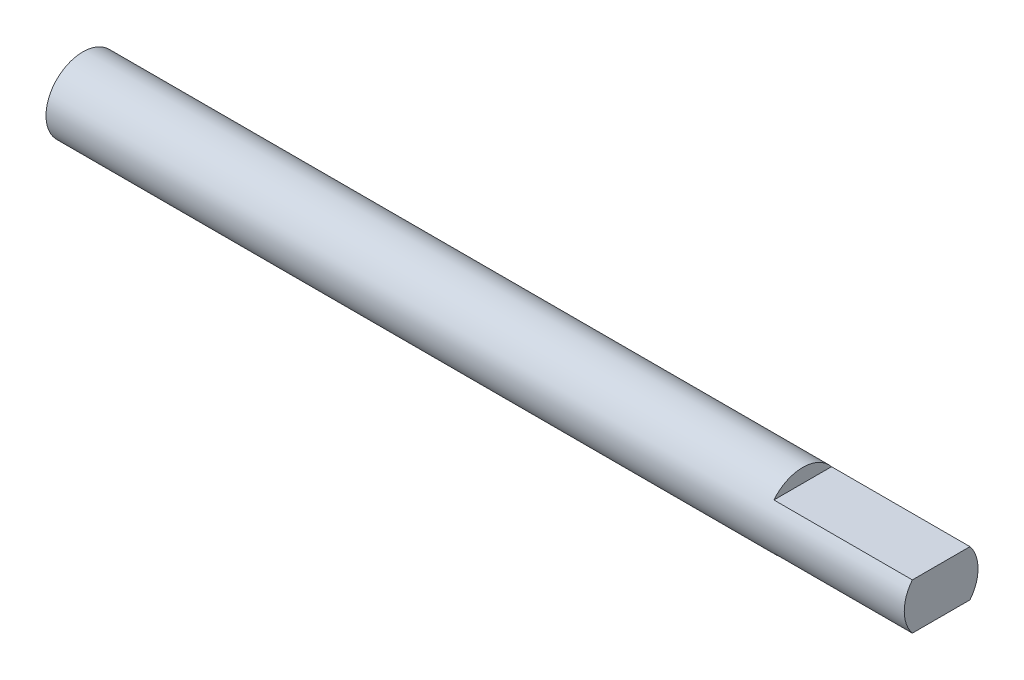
ISO-10303-21;
HEADER;
FILE_DESCRIPTION(('STEP AP214'),'2;1');
FILE_NAME('part.step','',(''),(''),'','','');
FILE_SCHEMA(('AUTOMOTIVE_DESIGN { 1 0 10303 214 1 1 1 1 }'));
ENDSEC;
DATA;
#1=APPLICATION_CONTEXT('core data for automotive mechanical design processes');
#2=APPLICATION_PROTOCOL_DEFINITION('international standard','automotive_design',2000,#1);
#3=PRODUCT_CONTEXT('',#1,'mechanical');
#4=PRODUCT('Part','Part','',(#3));
#5=PRODUCT_RELATED_PRODUCT_CATEGORY('part','',(#4));
#6=PRODUCT_DEFINITION_FORMATION('','',#4);
#7=PRODUCT_DEFINITION_CONTEXT('part definition',#1,'design');
#8=PRODUCT_DEFINITION('design','',#6,#7);
#9=PRODUCT_DEFINITION_SHAPE('','',#8);
#10=(LENGTH_UNIT() NAMED_UNIT(*) SI_UNIT(.MILLI.,.METRE.));
#11=(NAMED_UNIT(*) PLANE_ANGLE_UNIT() SI_UNIT($,.RADIAN.));
#12=(NAMED_UNIT(*) SI_UNIT($,.STERADIAN.) SOLID_ANGLE_UNIT());
#13=UNCERTAINTY_MEASURE_WITH_UNIT(LENGTH_MEASURE(1.E-05),#10,'distance_accuracy_value','');
#14=(GEOMETRIC_REPRESENTATION_CONTEXT(3) GLOBAL_UNCERTAINTY_ASSIGNED_CONTEXT((#13)) GLOBAL_UNIT_ASSIGNED_CONTEXT((#10,
#11,#12)) REPRESENTATION_CONTEXT('',''));
#15=CARTESIAN_POINT('',(0.,0.,0.));
#16=DIRECTION('',(0.,0.,1.));
#17=DIRECTION('',(1.,0.,0.));
#18=AXIS2_PLACEMENT_3D('',#15,#16,#17);
#19=CARTESIAN_POINT('',(0.,0.,0.));
#20=DIRECTION('',(1.,0.,0.));
#21=DIRECTION('',(0.,0.,-1.));
#22=AXIS2_PLACEMENT_3D('',#19,#20,#21);
#23=PLANE('',#22);
#24=CARTESIAN_POINT('',(0.,0.,0.));
#25=DIRECTION('',(-1.,0.,0.));
#26=DIRECTION('',(0.,0.,1.));
#27=AXIS2_PLACEMENT_3D('',#24,#25,#26);
#28=CIRCLE('',#27,4.);
#29=CARTESIAN_POINT('',(0.,0.,4.));
#30=VERTEX_POINT('',#29);
#31=EDGE_CURVE('E90',#30,#30,#28,.T.);
#32=ORIENTED_EDGE('',*,*,#31,.T.);
#33=EDGE_LOOP('',(#32));
#34=FACE_BOUND('',#33,.T.);
#35=ADVANCED_FACE('F33',(#34),#23,.F.);
#36=CARTESIAN_POINT('',(0.,0.,0.));
#37=DIRECTION('',(-1.,0.,0.));
#38=DIRECTION('',(0.,0.,1.));
#39=AXIS2_PLACEMENT_3D('',#36,#37,#38);
#40=CYLINDRICAL_SURFACE('',#39,4.);
#41=CARTESIAN_POINT('',(93.,0.,0.));
#42=DIRECTION('',(-1.,0.,0.));
#43=DIRECTION('',(0.,0.,1.));
#44=AXIS2_PLACEMENT_3D('',#41,#42,#43);
#45=CIRCLE('',#44,4.);
#46=CARTESIAN_POINT('',(93.,2.5,-3.1224989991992));
#47=VERTEX_POINT('',#46);
#48=CARTESIAN_POINT('',(93.,-2.49999999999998,-3.12249899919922));
#49=VERTEX_POINT('',#48);
#50=EDGE_CURVE('E87',#47,#49,#45,.T.);
#51=ORIENTED_EDGE('',*,*,#50,.T.);
#52=DIRECTION('',(-1.,0.,0.));
#53=VECTOR('',#52,1.);
#54=CARTESIAN_POINT('',(0.,-2.49999999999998,-3.12249899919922));
#55=LINE('',#54,#53);
#56=CARTESIAN_POINT('',(78.,-2.49999999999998,-3.12249899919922));
#57=VERTEX_POINT('',#56);
#58=EDGE_CURVE('E47',#49,#57,#55,.T.);
#59=ORIENTED_EDGE('',*,*,#58,.T.);
#60=CARTESIAN_POINT('',(78.,0.,0.));
#61=DIRECTION('',(-1.,0.,0.));
#62=DIRECTION('',(0.,0.,1.));
#63=AXIS2_PLACEMENT_3D('',#60,#61,#62);
#64=CIRCLE('',#63,4.);
#65=CARTESIAN_POINT('',(78.,-2.50000000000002,3.12249899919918));
#66=VERTEX_POINT('',#65);
#67=EDGE_CURVE('E11',#57,#66,#64,.T.);
#68=ORIENTED_EDGE('',*,*,#67,.T.);
#69=DIRECTION('',(-1.,0.,0.));
#70=VECTOR('',#69,1.);
#71=CARTESIAN_POINT('',(0.,-2.50000000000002,3.12249899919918));
#72=LINE('',#71,#70);
#73=CARTESIAN_POINT('',(93.,-2.50000000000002,3.12249899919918));
#74=VERTEX_POINT('',#73);
#75=EDGE_CURVE('E74',#66,#74,#72,.F.);
#76=ORIENTED_EDGE('',*,*,#75,.T.);
#77=CARTESIAN_POINT('',(93.,2.5,3.1224989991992));
#78=VERTEX_POINT('',#77);
#79=EDGE_CURVE('E55',#74,#78,#45,.T.);
#80=ORIENTED_EDGE('',*,*,#79,.T.);
#81=DIRECTION('',(-1.,0.,0.));
#82=VECTOR('',#81,1.);
#83=CARTESIAN_POINT('',(0.,2.5,3.1224989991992));
#84=LINE('',#83,#82);
#85=CARTESIAN_POINT('',(78.,2.5,3.1224989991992));
#86=VERTEX_POINT('',#85);
#87=EDGE_CURVE('E88',#78,#86,#84,.T.);
#88=ORIENTED_EDGE('',*,*,#87,.T.);
#89=CARTESIAN_POINT('',(78.,0.,0.));
#90=DIRECTION('',(-1.,0.,0.));
#91=DIRECTION('',(0.,0.,1.));
#92=AXIS2_PLACEMENT_3D('',#89,#90,#91);
#93=CIRCLE('',#92,4.);
#94=CARTESIAN_POINT('',(78.,2.5,-3.1224989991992));
#95=VERTEX_POINT('',#94);
#96=EDGE_CURVE('E79',#86,#95,#93,.T.);
#97=ORIENTED_EDGE('',*,*,#96,.T.);
#98=DIRECTION('',(-1.,0.,0.));
#99=VECTOR('',#98,1.);
#100=CARTESIAN_POINT('',(0.,2.5,-3.1224989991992));
#101=LINE('',#100,#99);
#102=EDGE_CURVE('E91',#95,#47,#101,.F.);
#103=ORIENTED_EDGE('',*,*,#102,.T.);
#104=EDGE_LOOP('',(#51,#59,#68,#76,#80,#88,#97,#103));
#105=FACE_BOUND('',#104,.T.);
#106=ORIENTED_EDGE('',*,*,#31,.F.);
#107=EDGE_LOOP('',(#106));
#108=FACE_BOUND('',#107,.T.);
#109=ADVANCED_FACE('F80',(#105,#108),#40,.T.);
#110=CARTESIAN_POINT('',(93.,0.,0.));
#111=DIRECTION('',(-1.,0.,0.));
#112=DIRECTION('',(0.,0.,1.));
#113=AXIS2_PLACEMENT_3D('',#110,#111,#112);
#114=PLANE('',#113);
#115=ORIENTED_EDGE('',*,*,#79,.F.);
#116=DIRECTION('',(0.,0.,-1.));
#117=VECTOR('',#116,1.);
#118=CARTESIAN_POINT('',(93.,-2.5,0.));
#119=LINE('',#118,#117);
#120=EDGE_CURVE('E40',#74,#49,#119,.T.);
#121=ORIENTED_EDGE('',*,*,#120,.T.);
#122=ORIENTED_EDGE('',*,*,#50,.F.);
#123=DIRECTION('',(0.,0.,1.));
#124=VECTOR('',#123,1.);
#125=CARTESIAN_POINT('',(93.,2.5,0.));
#126=LINE('',#125,#124);
#127=EDGE_CURVE('E86',#47,#78,#126,.T.);
#128=ORIENTED_EDGE('',*,*,#127,.T.);
#129=EDGE_LOOP('',(#115,#121,#122,#128));
#130=FACE_BOUND('',#129,.T.);
#131=ADVANCED_FACE('F85',(#130),#114,.F.);
#132=CARTESIAN_POINT('',(78.,4.68602630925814,-0.350790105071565));
#133=DIRECTION('',(-1.,0.,0.));
#134=DIRECTION('',(0.,0.,1.));
#135=AXIS2_PLACEMENT_3D('',#132,#133,#134);
#136=PLANE('',#135);
#137=DIRECTION('',(0.,0.,-1.));
#138=VECTOR('',#137,1.);
#139=CARTESIAN_POINT('',(78.,2.5,4.38818565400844));
#140=LINE('',#139,#138);
#141=EDGE_CURVE('E104',#86,#95,#140,.T.);
#142=ORIENTED_EDGE('',*,*,#141,.T.);
#143=ORIENTED_EDGE('',*,*,#96,.F.);
#144=EDGE_LOOP('',(#142,#143));
#145=FACE_BOUND('',#144,.T.);
#146=ADVANCED_FACE('F103',(#145),#136,.F.);
#147=CARTESIAN_POINT('',(78.,2.5,4.38818565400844));
#148=DIRECTION('',(0.,-1.,0.));
#149=DIRECTION('',(0.,0.,-1.));
#150=AXIS2_PLACEMENT_3D('',#147,#148,#149);
#151=PLANE('',#150);
#152=ORIENTED_EDGE('',*,*,#127,.F.);
#153=ORIENTED_EDGE('',*,*,#102,.F.);
#154=ORIENTED_EDGE('',*,*,#141,.F.);
#155=ORIENTED_EDGE('',*,*,#87,.F.);
#156=EDGE_LOOP('',(#152,#153,#154,#155));
#157=FACE_BOUND('',#156,.T.);
#158=ADVANCED_FACE('F106',(#157),#151,.F.);
#159=CARTESIAN_POINT('',(78.,-4.68602630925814,0.350790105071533));
#160=DIRECTION('',(-1.,0.,0.));
#161=DIRECTION('',(0.,0.,-1.));
#162=AXIS2_PLACEMENT_3D('',#159,#160,#161);
#163=PLANE('',#162);
#164=DIRECTION('',(0.,0.,1.));
#165=VECTOR('',#164,1.);
#166=CARTESIAN_POINT('',(78.,-2.49999999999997,-4.38818565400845));
#167=LINE('',#166,#165);
#168=EDGE_CURVE('E82',#57,#66,#167,.T.);
#169=ORIENTED_EDGE('',*,*,#168,.T.);
#170=ORIENTED_EDGE('',*,*,#67,.F.);
#171=EDGE_LOOP('',(#169,#170));
#172=FACE_BOUND('',#171,.T.);
#173=ADVANCED_FACE('F111',(#172),#163,.F.);
#174=CARTESIAN_POINT('',(78.,-2.49999999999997,-4.38818565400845));
#175=DIRECTION('',(0.,1.,0.));
#176=DIRECTION('',(0.,0.,1.));
#177=AXIS2_PLACEMENT_3D('',#174,#175,#176);
#178=PLANE('',#177);
#179=ORIENTED_EDGE('',*,*,#120,.F.);
#180=ORIENTED_EDGE('',*,*,#75,.F.);
#181=ORIENTED_EDGE('',*,*,#168,.F.);
#182=ORIENTED_EDGE('',*,*,#58,.F.);
#183=EDGE_LOOP('',(#179,#180,#181,#182));
#184=FACE_BOUND('',#183,.T.);
#185=ADVANCED_FACE('F73',(#184),#178,.F.);
#186=CLOSED_SHELL('',(#35,#109,#131,#146,#158,#173,#185));
#187=MANIFOLD_SOLID_BREP('B2',#186);
#188=ADVANCED_BREP_SHAPE_REPRESENTATION('',(#18,#187),#14);
#189=SHAPE_DEFINITION_REPRESENTATION(#9,#188);
ENDSEC;
END-ISO-10303-21;
